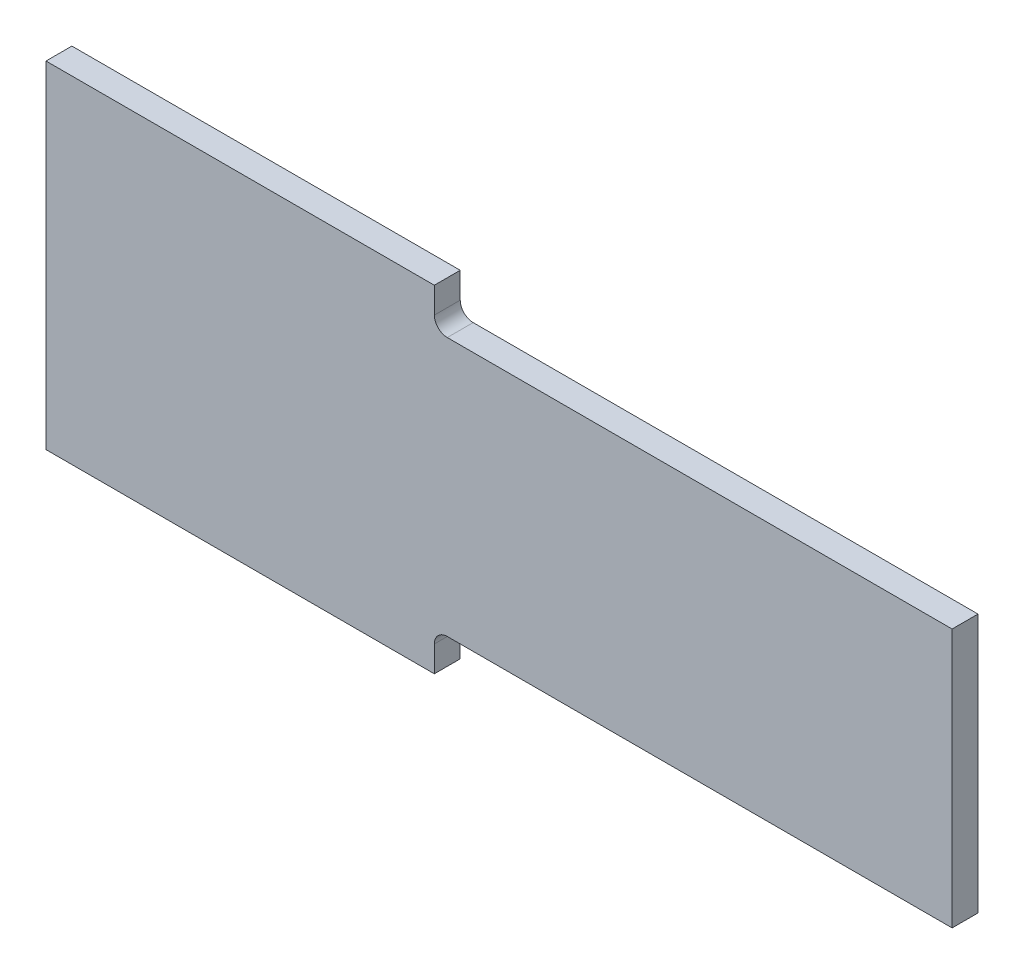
ISO-10303-21;
HEADER;
FILE_DESCRIPTION(('STEP AP214'),'2;1');
FILE_NAME('part.step','',(''),(''),'','','');
FILE_SCHEMA(('AUTOMOTIVE_DESIGN { 1 0 10303 214 1 1 1 1 }'));
ENDSEC;
DATA;
#1=APPLICATION_CONTEXT('core data for automotive mechanical design processes');
#2=APPLICATION_PROTOCOL_DEFINITION('international standard','automotive_design',2000,#1);
#3=PRODUCT_CONTEXT('',#1,'mechanical');
#4=PRODUCT('Part','Part','',(#3));
#5=PRODUCT_RELATED_PRODUCT_CATEGORY('part','',(#4));
#6=PRODUCT_DEFINITION_FORMATION('','',#4);
#7=PRODUCT_DEFINITION_CONTEXT('part definition',#1,'design');
#8=PRODUCT_DEFINITION('design','',#6,#7);
#9=PRODUCT_DEFINITION_SHAPE('','',#8);
#10=(LENGTH_UNIT() NAMED_UNIT(*) SI_UNIT(.MILLI.,.METRE.));
#11=(NAMED_UNIT(*) PLANE_ANGLE_UNIT() SI_UNIT($,.RADIAN.));
#12=(NAMED_UNIT(*) SI_UNIT($,.STERADIAN.) SOLID_ANGLE_UNIT());
#13=UNCERTAINTY_MEASURE_WITH_UNIT(LENGTH_MEASURE(1.E-05),#10,'distance_accuracy_value','');
#14=(GEOMETRIC_REPRESENTATION_CONTEXT(3) GLOBAL_UNCERTAINTY_ASSIGNED_CONTEXT((#13)) GLOBAL_UNIT_ASSIGNED_CONTEXT((#10,
#11,#12)) REPRESENTATION_CONTEXT('',''));
#15=CARTESIAN_POINT('',(0.,0.,0.));
#16=DIRECTION('',(0.,0.,1.));
#17=DIRECTION('',(1.,0.,0.));
#18=AXIS2_PLACEMENT_3D('',#15,#16,#17);
#19=CARTESIAN_POINT('',(0.,-6.50000000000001,1.));
#20=DIRECTION('',(0.,1.,0.));
#21=DIRECTION('',(0.,0.,1.));
#22=AXIS2_PLACEMENT_3D('',#19,#20,#21);
#23=PLANE('',#22);
#24=DIRECTION('',(1.,0.,0.));
#25=VECTOR('',#24,1.);
#26=CARTESIAN_POINT('',(0.,-6.50000000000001,0.));
#27=LINE('',#26,#25);
#28=CARTESIAN_POINT('',(0.,-6.50000000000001,0.));
#29=VERTEX_POINT('',#28);
#30=CARTESIAN_POINT('',(15.,-6.50000000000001,0.));
#31=VERTEX_POINT('',#30);
#32=EDGE_CURVE('E148',#29,#31,#27,.T.);
#33=ORIENTED_EDGE('',*,*,#32,.T.);
#34=DIRECTION('',(0.,0.,-1.));
#35=VECTOR('',#34,1.);
#36=CARTESIAN_POINT('',(15.,-6.50000000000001,1.));
#37=LINE('',#36,#35);
#38=CARTESIAN_POINT('',(15.,-6.50000000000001,1.));
#39=VERTEX_POINT('',#38);
#40=EDGE_CURVE('E12',#39,#31,#37,.T.);
#41=ORIENTED_EDGE('',*,*,#40,.F.);
#42=DIRECTION('',(1.,0.,0.));
#43=VECTOR('',#42,1.);
#44=CARTESIAN_POINT('',(0.,-6.50000000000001,1.));
#45=LINE('',#44,#43);
#46=CARTESIAN_POINT('',(0.,-6.50000000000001,1.));
#47=VERTEX_POINT('',#46);
#48=EDGE_CURVE('E159',#47,#39,#45,.T.);
#49=ORIENTED_EDGE('',*,*,#48,.F.);
#50=DIRECTION('',(0.,0.,-1.));
#51=VECTOR('',#50,1.);
#52=CARTESIAN_POINT('',(0.,-6.50000000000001,1.));
#53=LINE('',#52,#51);
#54=EDGE_CURVE('E143',#47,#29,#53,.T.);
#55=ORIENTED_EDGE('',*,*,#54,.T.);
#56=EDGE_LOOP('',(#33,#41,#49,#55));
#57=FACE_BOUND('',#56,.T.);
#58=ADVANCED_FACE('F39',(#57),#23,.F.);
#59=CARTESIAN_POINT('',(15.,-6.50000000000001,1.));
#60=DIRECTION('',(-1.,0.,0.));
#61=DIRECTION('',(0.,0.,1.));
#62=AXIS2_PLACEMENT_3D('',#59,#60,#61);
#63=PLANE('',#62);
#64=DIRECTION('',(0.,1.,0.));
#65=VECTOR('',#64,1.);
#66=CARTESIAN_POINT('',(15.,-6.50000000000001,0.));
#67=LINE('',#66,#65);
#68=CARTESIAN_POINT('',(15.,-5.5,0.));
#69=VERTEX_POINT('',#68);
#70=EDGE_CURVE('E187',#31,#69,#67,.T.);
#71=ORIENTED_EDGE('',*,*,#70,.T.);
#72=DIRECTION('',(0.,0.,-1.));
#73=VECTOR('',#72,1.);
#74=CARTESIAN_POINT('',(15.,-5.5,1.));
#75=LINE('',#74,#73);
#76=CARTESIAN_POINT('',(15.,-5.5,1.));
#77=VERTEX_POINT('',#76);
#78=EDGE_CURVE('E47',#77,#69,#75,.T.);
#79=ORIENTED_EDGE('',*,*,#78,.F.);
#80=DIRECTION('',(0.,1.,0.));
#81=VECTOR('',#80,1.);
#82=CARTESIAN_POINT('',(15.,-6.50000000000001,1.));
#83=LINE('',#82,#81);
#84=EDGE_CURVE('E104',#39,#77,#83,.T.);
#85=ORIENTED_EDGE('',*,*,#84,.F.);
#86=ORIENTED_EDGE('',*,*,#40,.T.);
#87=EDGE_LOOP('',(#71,#79,#85,#86));
#88=FACE_BOUND('',#87,.T.);
#89=ADVANCED_FACE('F232',(#88),#63,.F.);
#90=CARTESIAN_POINT('',(15.5,-5.5,1.));
#91=DIRECTION('',(0.,0.,-1.));
#92=DIRECTION('',(-1.,0.,0.));
#93=AXIS2_PLACEMENT_3D('',#90,#91,#92);
#94=CYLINDRICAL_SURFACE('',#93,0.5);
#95=CARTESIAN_POINT('',(15.5,-5.5,0.));
#96=DIRECTION('',(0.,0.,-1.));
#97=DIRECTION('',(1.,0.,0.));
#98=AXIS2_PLACEMENT_3D('',#95,#96,#97);
#99=CIRCLE('',#98,0.5);
#100=CARTESIAN_POINT('',(15.5,-5.,0.));
#101=VERTEX_POINT('',#100);
#102=EDGE_CURVE('E181',#69,#101,#99,.T.);
#103=ORIENTED_EDGE('',*,*,#102,.T.);
#104=DIRECTION('',(0.,0.,-1.));
#105=VECTOR('',#104,1.);
#106=CARTESIAN_POINT('',(15.5,-5.,1.));
#107=LINE('',#106,#105);
#108=CARTESIAN_POINT('',(15.5,-5.,1.));
#109=VERTEX_POINT('',#108);
#110=EDGE_CURVE('E173',#109,#101,#107,.T.);
#111=ORIENTED_EDGE('',*,*,#110,.F.);
#112=CARTESIAN_POINT('',(15.5,-5.5,1.));
#113=DIRECTION('',(0.,0.,-1.));
#114=DIRECTION('',(1.,0.,0.));
#115=AXIS2_PLACEMENT_3D('',#112,#113,#114);
#116=CIRCLE('',#115,0.5);
#117=EDGE_CURVE('E182',#77,#109,#116,.T.);
#118=ORIENTED_EDGE('',*,*,#117,.F.);
#119=ORIENTED_EDGE('',*,*,#78,.T.);
#120=EDGE_LOOP('',(#103,#111,#118,#119));
#121=FACE_BOUND('',#120,.T.);
#122=ADVANCED_FACE('F179',(#121),#94,.F.);
#123=CARTESIAN_POINT('',(15.5,-5.,1.));
#124=DIRECTION('',(0.,1.,0.));
#125=DIRECTION('',(0.,0.,1.));
#126=AXIS2_PLACEMENT_3D('',#123,#124,#125);
#127=PLANE('',#126);
#128=DIRECTION('',(1.,0.,0.));
#129=VECTOR('',#128,1.);
#130=CARTESIAN_POINT('',(15.5,-5.,0.));
#131=LINE('',#130,#129);
#132=CARTESIAN_POINT('',(35.,-5.,0.));
#133=VERTEX_POINT('',#132);
#134=EDGE_CURVE('E189',#101,#133,#131,.T.);
#135=ORIENTED_EDGE('',*,*,#134,.T.);
#136=DIRECTION('',(0.,0.,-1.));
#137=VECTOR('',#136,1.);
#138=CARTESIAN_POINT('',(35.,-5.,1.));
#139=LINE('',#138,#137);
#140=CARTESIAN_POINT('',(35.,-5.,1.));
#141=VERTEX_POINT('',#140);
#142=EDGE_CURVE('E170',#141,#133,#139,.T.);
#143=ORIENTED_EDGE('',*,*,#142,.F.);
#144=DIRECTION('',(1.,0.,0.));
#145=VECTOR('',#144,1.);
#146=CARTESIAN_POINT('',(15.5,-5.,1.));
#147=LINE('',#146,#145);
#148=EDGE_CURVE('E204',#109,#141,#147,.T.);
#149=ORIENTED_EDGE('',*,*,#148,.F.);
#150=ORIENTED_EDGE('',*,*,#110,.T.);
#151=EDGE_LOOP('',(#135,#143,#149,#150));
#152=FACE_BOUND('',#151,.T.);
#153=ADVANCED_FACE('F239',(#152),#127,.F.);
#154=CARTESIAN_POINT('',(35.,-5.,1.));
#155=DIRECTION('',(-1.,0.,0.));
#156=DIRECTION('',(0.,0.,1.));
#157=AXIS2_PLACEMENT_3D('',#154,#155,#156);
#158=PLANE('',#157);
#159=DIRECTION('',(0.,1.,0.));
#160=VECTOR('',#159,1.);
#161=CARTESIAN_POINT('',(35.,-5.,0.));
#162=LINE('',#161,#160);
#163=CARTESIAN_POINT('',(35.,5.,0.));
#164=VERTEX_POINT('',#163);
#165=EDGE_CURVE('E191',#133,#164,#162,.T.);
#166=ORIENTED_EDGE('',*,*,#165,.T.);
#167=DIRECTION('',(0.,0.,-1.));
#168=VECTOR('',#167,1.);
#169=CARTESIAN_POINT('',(35.,5.,1.));
#170=LINE('',#169,#168);
#171=CARTESIAN_POINT('',(35.,5.,1.));
#172=VERTEX_POINT('',#171);
#173=EDGE_CURVE('E167',#172,#164,#170,.T.);
#174=ORIENTED_EDGE('',*,*,#173,.F.);
#175=DIRECTION('',(0.,1.,0.));
#176=VECTOR('',#175,1.);
#177=CARTESIAN_POINT('',(35.,-5.,1.));
#178=LINE('',#177,#176);
#179=EDGE_CURVE('E200',#141,#172,#178,.T.);
#180=ORIENTED_EDGE('',*,*,#179,.F.);
#181=ORIENTED_EDGE('',*,*,#142,.T.);
#182=EDGE_LOOP('',(#166,#174,#180,#181));
#183=FACE_BOUND('',#182,.T.);
#184=ADVANCED_FACE('F244',(#183),#158,.F.);
#185=CARTESIAN_POINT('',(15.5,5.,1.));
#186=DIRECTION('',(0.,-1.,0.));
#187=DIRECTION('',(0.,0.,-1.));
#188=AXIS2_PLACEMENT_3D('',#185,#186,#187);
#189=PLANE('',#188);
#190=DIRECTION('',(-1.,0.,0.));
#191=VECTOR('',#190,1.);
#192=CARTESIAN_POINT('',(15.5,5.,0.));
#193=LINE('',#192,#191);
#194=CARTESIAN_POINT('',(15.5,5.,0.));
#195=VERTEX_POINT('',#194);
#196=EDGE_CURVE('E195',#164,#195,#193,.T.);
#197=ORIENTED_EDGE('',*,*,#196,.T.);
#198=DIRECTION('',(0.,0.,-1.));
#199=VECTOR('',#198,1.);
#200=CARTESIAN_POINT('',(15.5,5.,1.));
#201=LINE('',#200,#199);
#202=CARTESIAN_POINT('',(15.5,5.,1.));
#203=VERTEX_POINT('',#202);
#204=EDGE_CURVE('E164',#203,#195,#201,.T.);
#205=ORIENTED_EDGE('',*,*,#204,.F.);
#206=DIRECTION('',(-1.,0.,0.));
#207=VECTOR('',#206,1.);
#208=CARTESIAN_POINT('',(15.5,5.,1.));
#209=LINE('',#208,#207);
#210=EDGE_CURVE('E203',#172,#203,#209,.T.);
#211=ORIENTED_EDGE('',*,*,#210,.F.);
#212=ORIENTED_EDGE('',*,*,#173,.T.);
#213=EDGE_LOOP('',(#197,#205,#211,#212));
#214=FACE_BOUND('',#213,.T.);
#215=ADVANCED_FACE('F212',(#214),#189,.F.);
#216=CARTESIAN_POINT('',(15.5,5.5,1.));
#217=DIRECTION('',(0.,0.,-1.));
#218=DIRECTION('',(-1.,0.,0.));
#219=AXIS2_PLACEMENT_3D('',#216,#217,#218);
#220=CYLINDRICAL_SURFACE('',#219,0.5);
#221=CARTESIAN_POINT('',(15.5,5.5,0.));
#222=DIRECTION('',(0.,0.,-1.));
#223=DIRECTION('',(-1.,0.,0.));
#224=AXIS2_PLACEMENT_3D('',#221,#222,#223);
#225=CIRCLE('',#224,0.5);
#226=CARTESIAN_POINT('',(15.,5.5,0.));
#227=VERTEX_POINT('',#226);
#228=EDGE_CURVE('E198',#195,#227,#225,.T.);
#229=ORIENTED_EDGE('',*,*,#228,.T.);
#230=DIRECTION('',(0.,0.,-1.));
#231=VECTOR('',#230,1.);
#232=CARTESIAN_POINT('',(15.,5.5,1.));
#233=LINE('',#232,#231);
#234=CARTESIAN_POINT('',(15.,5.5,1.));
#235=VERTEX_POINT('',#234);
#236=EDGE_CURVE('E138',#235,#227,#233,.T.);
#237=ORIENTED_EDGE('',*,*,#236,.F.);
#238=CARTESIAN_POINT('',(15.5,5.5,1.));
#239=DIRECTION('',(0.,0.,-1.));
#240=DIRECTION('',(-1.,0.,0.));
#241=AXIS2_PLACEMENT_3D('',#238,#239,#240);
#242=CIRCLE('',#241,0.5);
#243=EDGE_CURVE('E129',#203,#235,#242,.T.);
#244=ORIENTED_EDGE('',*,*,#243,.F.);
#245=ORIENTED_EDGE('',*,*,#204,.T.);
#246=EDGE_LOOP('',(#229,#237,#244,#245));
#247=FACE_BOUND('',#246,.T.);
#248=ADVANCED_FACE('F216',(#247),#220,.F.);
#249=CARTESIAN_POINT('',(15.,6.5,1.));
#250=DIRECTION('',(-1.,0.,0.));
#251=DIRECTION('',(0.,0.,1.));
#252=AXIS2_PLACEMENT_3D('',#249,#250,#251);
#253=PLANE('',#252);
#254=DIRECTION('',(0.,1.,0.));
#255=VECTOR('',#254,1.);
#256=CARTESIAN_POINT('',(15.,6.5,0.));
#257=LINE('',#256,#255);
#258=CARTESIAN_POINT('',(15.,6.5,0.));
#259=VERTEX_POINT('',#258);
#260=EDGE_CURVE('E137',#227,#259,#257,.T.);
#261=ORIENTED_EDGE('',*,*,#260,.T.);
#262=DIRECTION('',(0.,0.,-1.));
#263=VECTOR('',#262,1.);
#264=CARTESIAN_POINT('',(15.,6.5,1.));
#265=LINE('',#264,#263);
#266=CARTESIAN_POINT('',(15.,6.5,1.));
#267=VERTEX_POINT('',#266);
#268=EDGE_CURVE('E134',#267,#259,#265,.T.);
#269=ORIENTED_EDGE('',*,*,#268,.F.);
#270=DIRECTION('',(0.,1.,0.));
#271=VECTOR('',#270,1.);
#272=CARTESIAN_POINT('',(15.,6.5,1.));
#273=LINE('',#272,#271);
#274=EDGE_CURVE('E123',#235,#267,#273,.T.);
#275=ORIENTED_EDGE('',*,*,#274,.F.);
#276=ORIENTED_EDGE('',*,*,#236,.T.);
#277=EDGE_LOOP('',(#261,#269,#275,#276));
#278=FACE_BOUND('',#277,.T.);
#279=ADVANCED_FACE('F135',(#278),#253,.F.);
#280=CARTESIAN_POINT('',(0.,6.5,1.));
#281=DIRECTION('',(0.,-1.,0.));
#282=DIRECTION('',(0.,0.,-1.));
#283=AXIS2_PLACEMENT_3D('',#280,#281,#282);
#284=PLANE('',#283);
#285=DIRECTION('',(-1.,0.,0.));
#286=VECTOR('',#285,1.);
#287=CARTESIAN_POINT('',(0.,6.5,0.));
#288=LINE('',#287,#286);
#289=CARTESIAN_POINT('',(0.,6.5,0.));
#290=VERTEX_POINT('',#289);
#291=EDGE_CURVE('E90',#259,#290,#288,.T.);
#292=ORIENTED_EDGE('',*,*,#291,.T.);
#293=DIRECTION('',(0.,0.,-1.));
#294=VECTOR('',#293,1.);
#295=CARTESIAN_POINT('',(0.,6.5,1.));
#296=LINE('',#295,#294);
#297=CARTESIAN_POINT('',(0.,6.5,1.));
#298=VERTEX_POINT('',#297);
#299=EDGE_CURVE('E139',#298,#290,#296,.T.);
#300=ORIENTED_EDGE('',*,*,#299,.F.);
#301=DIRECTION('',(-1.,0.,0.));
#302=VECTOR('',#301,1.);
#303=CARTESIAN_POINT('',(0.,6.5,1.));
#304=LINE('',#303,#302);
#305=EDGE_CURVE('E127',#267,#298,#304,.T.);
#306=ORIENTED_EDGE('',*,*,#305,.F.);
#307=ORIENTED_EDGE('',*,*,#268,.T.);
#308=EDGE_LOOP('',(#292,#300,#306,#307));
#309=FACE_BOUND('',#308,.T.);
#310=ADVANCED_FACE('F141',(#309),#284,.F.);
#311=CARTESIAN_POINT('',(0.,-6.50000000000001,1.));
#312=DIRECTION('',(1.,0.,0.));
#313=DIRECTION('',(0.,0.,-1.));
#314=AXIS2_PLACEMENT_3D('',#311,#312,#313);
#315=PLANE('',#314);
#316=DIRECTION('',(0.,-1.,0.));
#317=VECTOR('',#316,1.);
#318=CARTESIAN_POINT('',(0.,-6.50000000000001,0.));
#319=LINE('',#318,#317);
#320=EDGE_CURVE('E96',#290,#29,#319,.T.);
#321=ORIENTED_EDGE('',*,*,#320,.T.);
#322=ORIENTED_EDGE('',*,*,#54,.F.);
#323=DIRECTION('',(0.,-1.,0.));
#324=VECTOR('',#323,1.);
#325=CARTESIAN_POINT('',(0.,-6.50000000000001,1.));
#326=LINE('',#325,#324);
#327=EDGE_CURVE('E55',#298,#47,#326,.T.);
#328=ORIENTED_EDGE('',*,*,#327,.F.);
#329=ORIENTED_EDGE('',*,*,#299,.T.);
#330=EDGE_LOOP('',(#321,#322,#328,#329));
#331=FACE_BOUND('',#330,.T.);
#332=ADVANCED_FACE('F221',(#331),#315,.F.);
#333=CARTESIAN_POINT('',(15.5,-5.5,1.));
#334=DIRECTION('',(0.,0.,1.));
#335=DIRECTION('',(1.,0.,0.));
#336=AXIS2_PLACEMENT_3D('',#333,#334,#335);
#337=PLANE('',#336);
#338=ORIENTED_EDGE('',*,*,#48,.T.);
#339=ORIENTED_EDGE('',*,*,#84,.T.);
#340=ORIENTED_EDGE('',*,*,#117,.T.);
#341=ORIENTED_EDGE('',*,*,#148,.T.);
#342=ORIENTED_EDGE('',*,*,#179,.T.);
#343=ORIENTED_EDGE('',*,*,#210,.T.);
#344=ORIENTED_EDGE('',*,*,#243,.T.);
#345=ORIENTED_EDGE('',*,*,#274,.T.);
#346=ORIENTED_EDGE('',*,*,#305,.T.);
#347=ORIENTED_EDGE('',*,*,#327,.T.);
#348=EDGE_LOOP('',(#338,#339,#340,#341,#342,#343,#344,#345,#346,#347));
#349=FACE_BOUND('',#348,.T.);
#350=ADVANCED_FACE('F125',(#349),#337,.T.);
#351=CARTESIAN_POINT('',(15.5,-5.5,0.));
#352=DIRECTION('',(0.,0.,1.));
#353=DIRECTION('',(1.,0.,0.));
#354=AXIS2_PLACEMENT_3D('',#351,#352,#353);
#355=PLANE('',#354);
#356=ORIENTED_EDGE('',*,*,#32,.F.);
#357=ORIENTED_EDGE('',*,*,#320,.F.);
#358=ORIENTED_EDGE('',*,*,#291,.F.);
#359=ORIENTED_EDGE('',*,*,#260,.F.);
#360=ORIENTED_EDGE('',*,*,#228,.F.);
#361=ORIENTED_EDGE('',*,*,#196,.F.);
#362=ORIENTED_EDGE('',*,*,#165,.F.);
#363=ORIENTED_EDGE('',*,*,#134,.F.);
#364=ORIENTED_EDGE('',*,*,#102,.F.);
#365=ORIENTED_EDGE('',*,*,#70,.F.);
#366=EDGE_LOOP('',(#356,#357,#358,#359,#360,#361,#362,#363,#364,#365));
#367=FACE_BOUND('',#366,.T.);
#368=ADVANCED_FACE('F186',(#367),#355,.F.);
#369=CLOSED_SHELL('',(#58,#89,#122,#153,#184,#215,#248,#279,#310,#332,#350,#368));
#370=MANIFOLD_SOLID_BREP('B2',#369);
#371=ADVANCED_BREP_SHAPE_REPRESENTATION('',(#18,#370),#14);
#372=SHAPE_DEFINITION_REPRESENTATION(#9,#371);
ENDSEC;
END-ISO-10303-21;
